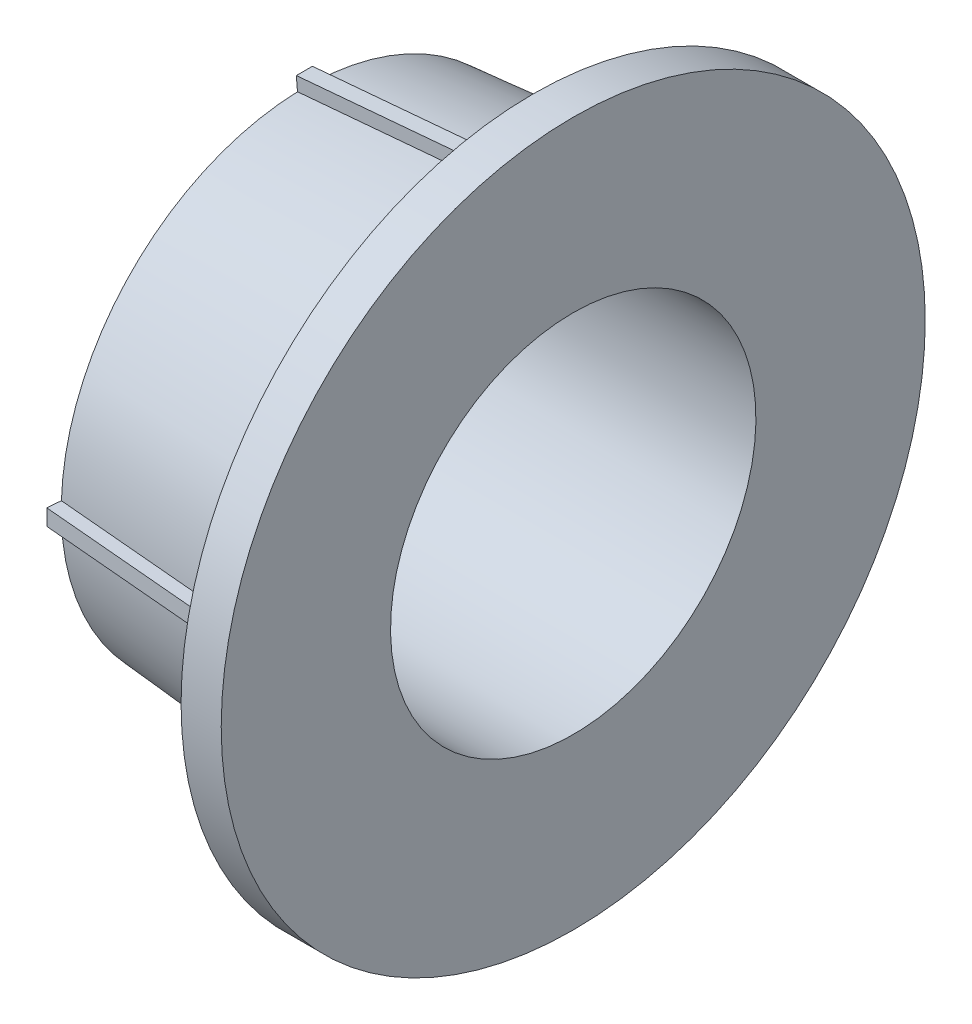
ISO-10303-21;
HEADER;
FILE_DESCRIPTION(('STEP AP214'),'2;1');
FILE_NAME('part.step','',(''),(''),'','','');
FILE_SCHEMA(('AUTOMOTIVE_DESIGN { 1 0 10303 214 1 1 1 1 }'));
ENDSEC;
DATA;
#1=APPLICATION_CONTEXT('core data for automotive mechanical design processes');
#2=APPLICATION_PROTOCOL_DEFINITION('international standard','automotive_design',2000,#1);
#3=PRODUCT_CONTEXT('',#1,'mechanical');
#4=PRODUCT('Part','Part','',(#3));
#5=PRODUCT_RELATED_PRODUCT_CATEGORY('part','',(#4));
#6=PRODUCT_DEFINITION_FORMATION('','',#4);
#7=PRODUCT_DEFINITION_CONTEXT('part definition',#1,'design');
#8=PRODUCT_DEFINITION('design','',#6,#7);
#9=PRODUCT_DEFINITION_SHAPE('','',#8);
#10=(LENGTH_UNIT() NAMED_UNIT(*) SI_UNIT(.MILLI.,.METRE.));
#11=(NAMED_UNIT(*) PLANE_ANGLE_UNIT() SI_UNIT($,.RADIAN.));
#12=(NAMED_UNIT(*) SI_UNIT($,.STERADIAN.) SOLID_ANGLE_UNIT());
#13=UNCERTAINTY_MEASURE_WITH_UNIT(LENGTH_MEASURE(1.E-05),#10,'distance_accuracy_value','');
#14=(GEOMETRIC_REPRESENTATION_CONTEXT(3) GLOBAL_UNCERTAINTY_ASSIGNED_CONTEXT((#13)) GLOBAL_UNIT_ASSIGNED_CONTEXT((#10,
#11,#12)) REPRESENTATION_CONTEXT('',''));
#15=CARTESIAN_POINT('',(0.,0.,0.));
#16=DIRECTION('',(0.,0.,1.));
#17=DIRECTION('',(1.,0.,0.));
#18=AXIS2_PLACEMENT_3D('',#15,#16,#17);
#19=CARTESIAN_POINT('',(16.9999999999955,29.6900321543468,-2.23776048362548E-12));
#20=DIRECTION('',(1.,0.,0.));
#21=DIRECTION('',(0.,-1.,0.));
#22=AXIS2_PLACEMENT_3D('',#19,#20,#21);
#23=CONICAL_SURFACE('',#22,19.7375000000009,0.0872777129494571);
#24=CARTESIAN_POINT('',(16.9999999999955,29.6900321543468,-2.23776048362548E-12));
#25=DIRECTION('',(-1.,0.,0.));
#26=DIRECTION('',(0.,-1.,0.));
#27=AXIS2_PLACEMENT_3D('',#24,#25,#26);
#28=CIRCLE('',#27,19.7375000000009);
#29=CARTESIAN_POINT('',(16.9999999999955,9.96165395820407,0.599999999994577));
#30=VERTEX_POINT('',#29);
#31=CARTESIAN_POINT('',(16.9999999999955,29.0900321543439,19.7283781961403));
#32=VERTEX_POINT('',#31);
#33=EDGE_CURVE('E376',#30,#32,#28,.T.);
#34=ORIENTED_EDGE('',*,*,#33,.T.);
#35=CARTESIAN_POINT('',(-30.1550080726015,29.0900321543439,15.5999025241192));
#36=CARTESIAN_POINT('',(-20.618338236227,29.0900321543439,16.43497432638));
#37=CARTESIAN_POINT('',(-11.0816605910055,29.0900321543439,17.2699569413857));
#38=CARTESIAN_POINT('',(0.276339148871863,29.0900321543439,18.2643278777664));
#39=CARTESIAN_POINT('',(2.09765580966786,29.0900321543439,18.4237782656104));
#40=CARTESIAN_POINT('',(15.2769748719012,29.0900321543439,19.5775691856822));
#41=CARTESIAN_POINT('',(26.634984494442,29.0900321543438,20.5718272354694));
#42=CARTESIAN_POINT('',(37.9929978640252,29.0900321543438,21.5660424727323));
#43=B_SPLINE_CURVE_WITH_KNOTS('',3,(#35,#36,#37,#38,#39,#40,#41,#42),.UNSPECIFIED.,.F.,.F.,(4,2,
2,4),(0.,28.7194837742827,34.2043328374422,68.4086656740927),.UNSPECIFIED.);
#44=CARTESIAN_POINT('',(1.43938680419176E-12,29.0900321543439,18.240134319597));
#45=VERTEX_POINT('',#44);
#46=EDGE_CURVE('E180',#45,#32,#43,.T.);
#47=ORIENTED_EDGE('',*,*,#46,.F.);
#48=CARTESIAN_POINT('',(-1.73819292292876E-11,29.6900321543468,-2.229054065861E-12));
#49=DIRECTION('',(-1.,0.,0.));
#50=DIRECTION('',(0.,-1.,0.));
#51=AXIS2_PLACEMENT_3D('',#48,#49,#50);
#52=CIRCLE('',#51,18.2499999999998);
#53=CARTESIAN_POINT('',(-1.7402716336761E-11,11.449897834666,0.599999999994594));
#54=VERTEX_POINT('',#53);
#55=EDGE_CURVE('E709',#54,#45,#52,.T.);
#56=ORIENTED_EDGE('',*,*,#55,.F.);
#57=CARTESIAN_POINT('',(37.993112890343,8.12397961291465,0.599999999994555));
#58=CARTESIAN_POINT('',(26.6350917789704,9.11816741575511,0.599999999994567));
#59=CARTESIAN_POINT('',(15.2770780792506,10.1124398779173,0.599999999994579));
#60=CARTESIAN_POINT('',(-7.43893449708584,12.1011541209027,0.599999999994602));
#61=CARTESIAN_POINT('',(-18.7969333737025,13.095595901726,0.599999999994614));
#62=CARTESIAN_POINT('',(-30.1549248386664,14.090122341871,0.599999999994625));
#63=B_SPLINE_CURVE_WITH_KNOTS('',3,(#57,#58,#59,#60,#61,#62),.UNSPECIFIED.,.F.,.F.,(4,2,4),(0.,
34.2043487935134,68.4086975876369),.UNSPECIFIED.);
#64=EDGE_CURVE('E260',#30,#54,#63,.T.);
#65=ORIENTED_EDGE('',*,*,#64,.F.);
#66=EDGE_LOOP('',(#34,#47,#56,#65));
#67=FACE_BOUND('',#66,.T.);
#68=ADVANCED_FACE('F33',(#67),#23,.T.);
#69=CARTESIAN_POINT('',(16.9999999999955,29.0900321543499,-19.7283781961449));
#70=VERTEX_POINT('',#69);
#71=CARTESIAN_POINT('',(16.9999999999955,9.96165395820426,-0.60000000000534));
#72=VERTEX_POINT('',#71);
#73=EDGE_CURVE('E381',#70,#72,#28,.T.);
#74=ORIENTED_EDGE('',*,*,#73,.T.);
#75=CARTESIAN_POINT('',(-30.1549248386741,14.0901223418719,-0.600000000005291));
#76=CARTESIAN_POINT('',(-20.6182505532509,13.255050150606,-0.600000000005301));
#77=CARTESIAN_POINT('',(-11.0815684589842,12.4200671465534,-0.600000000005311));
#78=CARTESIAN_POINT('',(0.276436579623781,11.4256957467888,-0.600000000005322));
#79=CARTESIAN_POINT('',(2.09775409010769,11.2662452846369,-0.600000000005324));
#80=CARTESIAN_POINT('',(15.2770793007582,10.1124538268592,-0.600000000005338));
#81=CARTESIAN_POINT('',(26.6350942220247,9.11819531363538,-0.60000000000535));
#82=CARTESIAN_POINT('',(37.9931128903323,8.12397961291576,-0.600000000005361));
#83=B_SPLINE_CURVE_WITH_KNOTS('',3,(#75,#76,#77,#78,#79,#80,#81,#82),.UNSPECIFIED.,.F.,.F.,(4,2,
2,4),(0.,28.7194971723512,34.2043487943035,68.4086975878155),.UNSPECIFIED.);
#84=CARTESIAN_POINT('',(1.07162542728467E-12,11.4498978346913,-0.600000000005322));
#85=VERTEX_POINT('',#84);
#86=EDGE_CURVE('E252',#85,#72,#83,.T.);
#87=ORIENTED_EDGE('',*,*,#86,.F.);
#88=CARTESIAN_POINT('',(-1.73919646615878E-11,29.0900321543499,-18.240134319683));
#89=VERTEX_POINT('',#88);
#90=EDGE_CURVE('E396',#89,#85,#52,.T.);
#91=ORIENTED_EDGE('',*,*,#90,.F.);
#92=CARTESIAN_POINT('',(37.9929978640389,29.0900321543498,-21.5660424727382));
#93=CARTESIAN_POINT('',(26.6349820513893,29.0900321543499,-20.5718551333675));
#94=CARTESIAN_POINT('',(15.276973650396,29.0900321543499,-19.5775831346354));
#95=CARTESIAN_POINT('',(-7.43902832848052,29.0900321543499,-17.588869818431));
#96=CARTESIAN_POINT('',(-18.7970219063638,29.0900321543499,-16.5944285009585));
#97=CARTESIAN_POINT('',(-30.1550080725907,29.0900321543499,-15.5999025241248));
#98=B_SPLINE_CURVE_WITH_KNOTS('',3,(#92,#93,#94,#95,#96,#97),.UNSPECIFIED.,.F.,.F.,(4,2,4),(0.,
34.204332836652,68.408665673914),.UNSPECIFIED.);
#99=EDGE_CURVE('E297',#70,#89,#98,.T.);
#100=ORIENTED_EDGE('',*,*,#99,.F.);
#101=EDGE_LOOP('',(#74,#87,#91,#100));
#102=FACE_BOUND('',#101,.T.);
#103=ADVANCED_FACE('F364',(#102),#23,.T.);
#104=CARTESIAN_POINT('',(16.9999999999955,49.4184103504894,-0.599999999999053));
#105=VERTEX_POINT('',#104);
#106=CARTESIAN_POINT('',(16.9999999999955,30.2900321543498,-19.7283781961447));
#107=VERTEX_POINT('',#106);
#108=EDGE_CURVE('E399',#105,#107,#28,.T.);
#109=ORIENTED_EDGE('',*,*,#108,.T.);
#110=CARTESIAN_POINT('',(-30.1550080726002,30.2900321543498,-15.5999025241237));
#111=CARTESIAN_POINT('',(-20.6183382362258,30.2900321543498,-16.4349743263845));
#112=CARTESIAN_POINT('',(-11.0816605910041,30.2900321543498,-17.2699569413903));
#113=CARTESIAN_POINT('',(0.276339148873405,30.2900321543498,-18.264327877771));
#114=CARTESIAN_POINT('',(2.09765580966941,30.2900321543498,-18.423778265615));
#115=CARTESIAN_POINT('',(15.2769748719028,30.2900321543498,-19.5775691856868));
#116=CARTESIAN_POINT('',(26.6349844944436,30.2900321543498,-20.571827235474));
#117=CARTESIAN_POINT('',(37.9929978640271,30.2900321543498,-21.566042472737));
#118=B_SPLINE_CURVE_WITH_KNOTS('',3,(#110,#111,#112,#113,#114,#115,#116,#117),.UNSPECIFIED.,.F.,
.F.,(4,2,2,4),(0.,28.7194837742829,34.2043328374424,68.4086656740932),.UNSPECIFIED.);
#119=CARTESIAN_POINT('',(-6.38486659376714E-12,30.2900321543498,-18.2401343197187));
#120=VERTEX_POINT('',#119);
#121=EDGE_CURVE('E289',#120,#107,#118,.T.);
#122=ORIENTED_EDGE('',*,*,#121,.F.);
#123=CARTESIAN_POINT('',(-1.73611421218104E-11,47.9301664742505,-0.599999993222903));
#124=VERTEX_POINT('',#123);
#125=EDGE_CURVE('E394',#124,#120,#52,.T.);
#126=ORIENTED_EDGE('',*,*,#125,.F.);
#127=CARTESIAN_POINT('',(37.9929978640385,51.2560746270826,-0.599999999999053));
#128=CARTESIAN_POINT('',(26.6349820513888,50.2618872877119,-0.599999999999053));
#129=CARTESIAN_POINT('',(15.2769736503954,49.2676152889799,-0.599999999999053));
#130=CARTESIAN_POINT('',(-7.43902832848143,47.2789019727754,-0.599999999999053));
#131=CARTESIAN_POINT('',(-18.7970219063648,46.284460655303,-0.599999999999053));
#132=CARTESIAN_POINT('',(-30.1550080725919,45.2899346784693,-0.599999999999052));
#133=B_SPLINE_CURVE_WITH_KNOTS('',3,(#127,#128,#129,#130,#131,#132),.UNSPECIFIED.,.F.,.F.,(4,2,
4),(0.,34.2043328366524,68.4086656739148),.UNSPECIFIED.);
#134=EDGE_CURVE('E334',#105,#124,#133,.T.);
#135=ORIENTED_EDGE('',*,*,#134,.F.);
#136=EDGE_LOOP('',(#109,#122,#126,#135));
#137=FACE_BOUND('',#136,.T.);
#138=ADVANCED_FACE('F354',(#137),#23,.T.);
#139=CARTESIAN_POINT('',(16.9999999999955,55.9900321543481,0.));
#140=DIRECTION('',(-1.,0.,0.));
#141=DIRECTION('',(0.,-1.,0.));
#142=AXIS2_PLACEMENT_3D('',#139,#140,#141);
#143=PLANE('',#142);
#144=DIRECTION('',(0.,0.,-1.));
#145=VECTOR('',#144,1.);
#146=CARTESIAN_POINT('',(16.9999999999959,29.0900321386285,-500001.48757496));
#147=LINE('',#146,#145);
#148=CARTESIAN_POINT('',(16.9999999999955,29.0900321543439,19.7374999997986));
#149=VERTEX_POINT('',#148);
#150=EDGE_CURVE('E209',#149,#32,#147,.T.);
#151=ORIENTED_EDGE('',*,*,#150,.T.);
#152=ORIENTED_EDGE('',*,*,#33,.F.);
#153=DIRECTION('',(0.,-1.,0.));
#154=VECTOR('',#153,1.);
#155=CARTESIAN_POINT('',(17.0000000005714,500000.,0.599999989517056));
#156=LINE('',#155,#154);
#157=CARTESIAN_POINT('',(16.9999999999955,9.95253215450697,0.599999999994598));
#158=VERTEX_POINT('',#157);
#159=EDGE_CURVE('E262',#30,#158,#156,.T.);
#160=ORIENTED_EDGE('',*,*,#159,.T.);
#161=DIRECTION('',(0.,0.,-1.));
#162=VECTOR('',#161,1.);
#163=CARTESIAN_POINT('',(16.9999999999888,9.95253215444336,-0.600000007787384));
#164=LINE('',#163,#162);
#165=CARTESIAN_POINT('',(16.9999999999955,9.95253215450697,-0.60000000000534));
#166=VERTEX_POINT('',#165);
#167=EDGE_CURVE('E447',#158,#166,#164,.T.);
#168=ORIENTED_EDGE('',*,*,#167,.T.);
#169=DIRECTION('',(0.,1.,0.));
#170=VECTOR('',#169,1.);
#171=CARTESIAN_POINT('',(17.0000000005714,500001.48757496,-0.600000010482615));
#172=LINE('',#171,#170);
#173=EDGE_CURVE('E434',#166,#72,#172,.T.);
#174=ORIENTED_EDGE('',*,*,#173,.T.);
#175=ORIENTED_EDGE('',*,*,#73,.F.);
#176=DIRECTION('',(0.,0.,-1.));
#177=VECTOR('',#176,1.);
#178=CARTESIAN_POINT('',(16.9999999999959,29.0900321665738,500000.));
#179=LINE('',#178,#177);
#180=CARTESIAN_POINT('',(16.9999999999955,29.0900321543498,-19.7374999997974));
#181=VERTEX_POINT('',#180);
#182=EDGE_CURVE('E299',#70,#181,#179,.T.);
#183=ORIENTED_EDGE('',*,*,#182,.T.);
#184=DIRECTION('',(0.,1.,0.));
#185=VECTOR('',#184,1.);
#186=CARTESIAN_POINT('',(16.9999999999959,30.2900321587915,-19.7374999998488));
#187=LINE('',#186,#185);
#188=CARTESIAN_POINT('',(16.9999999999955,30.2900321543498,-19.7374999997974));
#189=VERTEX_POINT('',#188);
#190=EDGE_CURVE('E461',#181,#189,#187,.T.);
#191=ORIENTED_EDGE('',*,*,#190,.T.);
#192=DIRECTION('',(0.,0.,1.));
#193=VECTOR('',#192,1.);
#194=CARTESIAN_POINT('',(16.9999999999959,30.2900321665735,500001.48757496));
#195=LINE('',#194,#193);
#196=EDGE_CURVE('E459',#189,#107,#195,.T.);
#197=ORIENTED_EDGE('',*,*,#196,.T.);
#198=ORIENTED_EDGE('',*,*,#108,.F.);
#199=DIRECTION('',(0.,1.,0.));
#200=VECTOR('',#199,1.);
#201=CARTESIAN_POINT('',(16.9999999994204,-500000.,-0.599999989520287));
#202=LINE('',#201,#200);
#203=CARTESIAN_POINT('',(16.9999999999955,49.4275321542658,-0.599999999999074));
#204=VERTEX_POINT('',#203);
#205=EDGE_CURVE('E405',#105,#204,#202,.T.);
#206=ORIENTED_EDGE('',*,*,#205,.T.);
#207=DIRECTION('',(0.,0.,1.));
#208=VECTOR('',#207,1.);
#209=CARTESIAN_POINT('',(16.9999999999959,49.4275321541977,0.600000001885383));
#210=LINE('',#209,#208);
#211=CARTESIAN_POINT('',(16.9999999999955,49.4275321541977,0.600000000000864));
#212=VERTEX_POINT('',#211);
#213=EDGE_CURVE('E336',#204,#212,#210,.T.);
#214=ORIENTED_EDGE('',*,*,#213,.T.);
#215=DIRECTION('',(0.,-1.,0.));
#216=VECTOR('',#215,1.);
#217=CARTESIAN_POINT('',(16.9999999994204,-500001.48757496,0.600000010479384));
#218=LINE('',#217,#216);
#219=CARTESIAN_POINT('',(16.9999999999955,49.4184103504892,0.600000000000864));
#220=VERTEX_POINT('',#219);
#221=EDGE_CURVE('E404',#212,#220,#218,.T.);
#222=ORIENTED_EDGE('',*,*,#221,.T.);
#223=CARTESIAN_POINT('',(16.9999999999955,30.2900321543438,19.7283781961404));
#224=VERTEX_POINT('',#223);
#225=EDGE_CURVE('E382',#224,#220,#28,.T.);
#226=ORIENTED_EDGE('',*,*,#225,.F.);
#227=DIRECTION('',(0.,0.,1.));
#228=VECTOR('',#227,1.);
#229=CARTESIAN_POINT('',(16.9999999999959,30.2900321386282,-500000.));
#230=LINE('',#229,#228);
#231=CARTESIAN_POINT('',(16.9999999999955,30.2900321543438,19.7374999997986));
#232=VERTEX_POINT('',#231);
#233=EDGE_CURVE('E212',#224,#232,#230,.T.);
#234=ORIENTED_EDGE('',*,*,#233,.T.);
#235=DIRECTION('',(0.,-1.,0.));
#236=VECTOR('',#235,1.);
#237=CARTESIAN_POINT('',(16.9999999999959,29.0900321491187,19.7374999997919));
#238=LINE('',#237,#236);
#239=EDGE_CURVE('E49',#232,#149,#238,.T.);
#240=ORIENTED_EDGE('',*,*,#239,.T.);
#241=EDGE_LOOP('',(#151,#152,#160,#168,#174,#175,#183,#191,#197,#198,#206,#214,#222,#226,#234,#240));
#242=FACE_BOUND('',#241,.T.);
#243=CARTESIAN_POINT('',(16.9999999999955,29.6900321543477,0.));
#244=DIRECTION('',(1.,0.,0.));
#245=DIRECTION('',(0.,1.,0.));
#246=AXIS2_PLACEMENT_3D('',#243,#244,#245);
#247=CIRCLE('',#246,26.3000000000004);
#248=CARTESIAN_POINT('',(16.9999999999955,55.9900321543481,0.));
#249=VERTEX_POINT('',#248);
#250=EDGE_CURVE('E11',#249,#249,#247,.T.);
#251=ORIENTED_EDGE('',*,*,#250,.F.);
#252=EDGE_LOOP('',(#251));
#253=FACE_BOUND('',#252,.T.);
#254=ADVANCED_FACE('F357',(#242,#253),#143,.T.);
#255=CARTESIAN_POINT('',(16.9999999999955,29.6900321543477,0.));
#256=DIRECTION('',(1.,0.,0.));
#257=DIRECTION('',(0.,1.,0.));
#258=AXIS2_PLACEMENT_3D('',#255,#256,#257);
#259=CYLINDRICAL_SURFACE('',#258,26.3000000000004);
#260=ORIENTED_EDGE('',*,*,#250,.T.);
#261=EDGE_LOOP('',(#260));
#262=FACE_BOUND('',#261,.T.);
#263=CARTESIAN_POINT('',(19.9999999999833,29.6900321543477,0.));
#264=DIRECTION('',(1.,0.,0.));
#265=DIRECTION('',(0.,1.,0.));
#266=AXIS2_PLACEMENT_3D('',#263,#264,#265);
#267=CIRCLE('',#266,26.3000000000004);
#268=CARTESIAN_POINT('',(19.9999999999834,55.9900321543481,0.));
#269=VERTEX_POINT('',#268);
#270=EDGE_CURVE('E42',#269,#269,#267,.T.);
#271=ORIENTED_EDGE('',*,*,#270,.F.);
#272=EDGE_LOOP('',(#271));
#273=FACE_BOUND('',#272,.T.);
#274=ADVANCED_FACE('F35',(#262,#273),#259,.T.);
#275=CARTESIAN_POINT('',(19.9999999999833,29.6900321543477,0.));
#276=DIRECTION('',(1.,0.,0.));
#277=DIRECTION('',(0.,1.,0.));
#278=AXIS2_PLACEMENT_3D('',#275,#276,#277);
#279=PLANE('',#278);
#280=CARTESIAN_POINT('',(19.9999999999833,29.6900321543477,0.));
#281=DIRECTION('',(1.,0.,0.));
#282=DIRECTION('',(0.,1.,0.));
#283=AXIS2_PLACEMENT_3D('',#280,#281,#282);
#284=CIRCLE('',#283,13.65);
#285=CARTESIAN_POINT('',(19.9999999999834,43.3400321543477,0.));
#286=VERTEX_POINT('',#285);
#287=EDGE_CURVE('E198',#286,#286,#284,.T.);
#288=ORIENTED_EDGE('',*,*,#287,.F.);
#289=EDGE_LOOP('',(#288));
#290=FACE_BOUND('',#289,.T.);
#291=ORIENTED_EDGE('',*,*,#270,.T.);
#292=EDGE_LOOP('',(#291));
#293=FACE_BOUND('',#292,.T.);
#294=ADVANCED_FACE('F352',(#290,#293),#279,.T.);
#295=CARTESIAN_POINT('',(-1.73718937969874E-11,30.2900321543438,18.2401343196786));
#296=VERTEX_POINT('',#295);
#297=CARTESIAN_POINT('',(-1.28315079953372E-11,47.9301664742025,0.600000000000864));
#298=VERTEX_POINT('',#297);
#299=EDGE_CURVE('E398',#296,#298,#52,.T.);
#300=ORIENTED_EDGE('',*,*,#299,.F.);
#301=CARTESIAN_POINT('',(37.9929978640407,30.2900321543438,21.5660424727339));
#302=CARTESIAN_POINT('',(26.634982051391,30.2900321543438,20.5718551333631));
#303=CARTESIAN_POINT('',(15.2769736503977,30.2900321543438,19.5775831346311));
#304=CARTESIAN_POINT('',(-7.43902832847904,30.2900321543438,17.5888698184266));
#305=CARTESIAN_POINT('',(-18.7970219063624,30.2900321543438,16.5944285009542));
#306=CARTESIAN_POINT('',(-30.1550080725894,30.2900321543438,15.5999025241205));
#307=B_SPLINE_CURVE_WITH_KNOTS('',3,(#301,#302,#303,#304,#305,#306),.UNSPECIFIED.,.F.,.F.,(4,2,
4),(0.,34.2043328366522,68.4086656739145),.UNSPECIFIED.);
#308=EDGE_CURVE('E177',#224,#296,#307,.T.);
#309=ORIENTED_EDGE('',*,*,#308,.F.);
#310=ORIENTED_EDGE('',*,*,#225,.T.);
#311=CARTESIAN_POINT('',(-30.1550080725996,45.2899346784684,0.600000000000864));
#312=CARTESIAN_POINT('',(-20.618338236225,46.1250064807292,0.600000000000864));
#313=CARTESIAN_POINT('',(-11.0816605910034,46.9599890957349,0.600000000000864));
#314=CARTESIAN_POINT('',(0.276339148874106,47.9543600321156,0.600000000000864));
#315=CARTESIAN_POINT('',(2.09765580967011,48.1138104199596,0.600000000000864));
#316=CARTESIAN_POINT('',(15.2769748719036,49.2676013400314,0.600000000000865));
#317=CARTESIAN_POINT('',(26.6349844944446,50.2618593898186,0.600000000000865));
#318=CARTESIAN_POINT('',(37.9929978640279,51.2560746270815,0.600000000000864));
#319=B_SPLINE_CURVE_WITH_KNOTS('',3,(#311,#312,#313,#314,#315,#316,#317,#318),.UNSPECIFIED.,.F.,
.F.,(4,2,2,4),(0.,28.719483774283,34.2043328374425,68.4086656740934),.UNSPECIFIED.);
#320=EDGE_CURVE('E326',#298,#220,#319,.T.);
#321=ORIENTED_EDGE('',*,*,#320,.F.);
#322=EDGE_LOOP('',(#300,#309,#310,#321));
#323=FACE_BOUND('',#322,.T.);
#324=ADVANCED_FACE('F348',(#323),#23,.T.);
#325=CARTESIAN_POINT('',(-1.73819292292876E-11,29.6900321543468,-2.229054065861E-12));
#326=DIRECTION('',(-1.,0.,0.));
#327=DIRECTION('',(0.,-1.,0.));
#328=AXIS2_PLACEMENT_3D('',#325,#326,#327);
#329=PLANE('',#328);
#330=CARTESIAN_POINT('',(-1.73819292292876E-11,29.6900321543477,0.));
#331=DIRECTION('',(-1.,0.,0.));
#332=DIRECTION('',(0.,-1.,0.));
#333=AXIS2_PLACEMENT_3D('',#330,#331,#332);
#334=CIRCLE('',#333,13.65);
#335=CARTESIAN_POINT('',(-1.73977152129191E-11,16.0400321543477,0.));
#336=VERTEX_POINT('',#335);
#337=EDGE_CURVE('E37',#336,#336,#334,.T.);
#338=ORIENTED_EDGE('',*,*,#337,.F.);
#339=EDGE_LOOP('',(#338));
#340=FACE_BOUND('',#339,.T.);
#341=DIRECTION('',(0.,1.,0.));
#342=VECTOR('',#341,1.);
#343=CARTESIAN_POINT('',(-1.4210854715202E-11,30.2900321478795,18.2401343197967));
#344=LINE('',#343,#342);
#345=EDGE_CURVE('E211',#45,#296,#344,.T.);
#346=ORIENTED_EDGE('',*,*,#345,.T.);
#347=ORIENTED_EDGE('',*,*,#299,.T.);
#348=DIRECTION('',(0.,0.,-1.));
#349=VECTOR('',#348,1.);
#350=CARTESIAN_POINT('',(-1.4210854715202E-11,47.9301664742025,-0.599999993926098));
#351=LINE('',#350,#349);
#352=EDGE_CURVE('E402',#298,#124,#351,.T.);
#353=ORIENTED_EDGE('',*,*,#352,.T.);
#354=ORIENTED_EDGE('',*,*,#125,.T.);
#355=DIRECTION('',(0.,-1.,0.));
#356=VECTOR('',#355,1.);
#357=CARTESIAN_POINT('',(-1.4210854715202E-11,29.0900321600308,-18.2401343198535));
#358=LINE('',#357,#356);
#359=EDGE_CURVE('E457',#120,#89,#358,.T.);
#360=ORIENTED_EDGE('',*,*,#359,.T.);
#361=ORIENTED_EDGE('',*,*,#90,.T.);
#362=DIRECTION('',(0.,0.,1.));
#363=VECTOR('',#362,1.);
#364=CARTESIAN_POINT('',(-2.1316282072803E-11,11.4498978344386,0.599999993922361));
#365=LINE('',#364,#363);
#366=EDGE_CURVE('E428',#85,#54,#365,.T.);
#367=ORIENTED_EDGE('',*,*,#366,.T.);
#368=ORIENTED_EDGE('',*,*,#55,.T.);
#369=EDGE_LOOP('',(#346,#347,#353,#354,#360,#361,#367,#368));
#370=FACE_BOUND('',#369,.T.);
#371=ADVANCED_FACE('F314',(#340,#370),#329,.T.);
#372=CARTESIAN_POINT('',(43771.3249090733,-500000.,0.600000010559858));
#373=DIRECTION('',(0.996193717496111,0.0871669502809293,0.));
#374=DIRECTION('',(-0.0871669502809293,0.996193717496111,0.));
#375=AXIS2_PLACEMENT_3D('',#372,#373,#374);
#376=PLANE('',#375);
#377=ORIENTED_EDGE('',*,*,#213,.F.);
#378=DIRECTION('',(-0.0871669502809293,0.996193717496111,0.));
#379=VECTOR('',#378,1.);
#380=CARTESIAN_POINT('',(43771.3249090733,-500000.,-0.599999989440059));
#381=LINE('',#380,#379);
#382=CARTESIAN_POINT('',(16.9128330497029,50.4237258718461,-0.599999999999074));
#383=VERTEX_POINT('',#382);
#384=EDGE_CURVE('E473',#204,#383,#381,.T.);
#385=ORIENTED_EDGE('',*,*,#384,.T.);
#386=DIRECTION('',(0.,0.,-1.));
#387=VECTOR('',#386,1.);
#388=CARTESIAN_POINT('',(16.9128330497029,50.4237258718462,0.600000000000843));
#389=LINE('',#388,#387);
#390=CARTESIAN_POINT('',(16.9128330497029,50.4237258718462,0.600000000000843));
#391=VERTEX_POINT('',#390);
#392=EDGE_CURVE('E470',#391,#383,#389,.T.);
#393=ORIENTED_EDGE('',*,*,#392,.F.);
#394=DIRECTION('',(-0.0871669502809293,0.996193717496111,0.));
#395=VECTOR('',#394,1.);
#396=CARTESIAN_POINT('',(43771.3249090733,-500000.,0.600000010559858));
#397=LINE('',#396,#395);
#398=EDGE_CURVE('E477',#212,#391,#397,.T.);
#399=ORIENTED_EDGE('',*,*,#398,.F.);
#400=EDGE_LOOP('',(#377,#385,#393,#399));
#401=FACE_BOUND('',#400,.T.);
#402=ADVANCED_FACE('F282',(#401),#376,.T.);
#403=CARTESIAN_POINT('',(43771.3249090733,-500000.,-0.599999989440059));
#404=DIRECTION('',(0.,0.,-1.));
#405=DIRECTION('',(0.,1.,0.));
#406=AXIS2_PLACEMENT_3D('',#403,#404,#405);
#407=PLANE('',#406);
#408=ORIENTED_EDGE('',*,*,#205,.F.);
#409=ORIENTED_EDGE('',*,*,#134,.T.);
#410=DIRECTION('',(-0.0871669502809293,0.996193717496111,0.));
#411=VECTOR('',#410,1.);
#412=CARTESIAN_POINT('',(43754.3240523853,-500001.48757496,-0.599999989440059));
#413=LINE('',#412,#411);
#414=CARTESIAN_POINT('',(-0.0880236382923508,48.9361509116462,-0.599999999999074));
#415=VERTEX_POINT('',#414);
#416=EDGE_CURVE('E335',#124,#415,#413,.T.);
#417=ORIENTED_EDGE('',*,*,#416,.T.);
#418=DIRECTION('',(-0.996193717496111,-0.0871669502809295,0.));
#419=VECTOR('',#418,1.);
#420=CARTESIAN_POINT('',(16.9128330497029,50.4237258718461,-0.599999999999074));
#421=LINE('',#420,#419);
#422=EDGE_CURVE('E467',#383,#415,#421,.T.);
#423=ORIENTED_EDGE('',*,*,#422,.F.);
#424=ORIENTED_EDGE('',*,*,#384,.F.);
#425=EDGE_LOOP('',(#408,#409,#417,#423,#424));
#426=FACE_BOUND('',#425,.T.);
#427=ADVANCED_FACE('F317',(#426),#407,.T.);
#428=CARTESIAN_POINT('',(43754.3240523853,-500001.48757496,-0.599999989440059));
#429=DIRECTION('',(-0.996193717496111,-0.0871669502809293,0.));
#430=DIRECTION('',(0.0871669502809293,-0.996193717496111,0.));
#431=AXIS2_PLACEMENT_3D('',#428,#429,#430);
#432=PLANE('',#431);
#433=ORIENTED_EDGE('',*,*,#352,.F.);
#434=DIRECTION('',(-0.0871669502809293,0.996193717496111,0.));
#435=VECTOR('',#434,1.);
#436=CARTESIAN_POINT('',(43754.3240523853,-500001.48757496,0.600000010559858));
#437=LINE('',#436,#435);
#438=CARTESIAN_POINT('',(-0.0880236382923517,48.9361509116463,0.600000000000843));
#439=VERTEX_POINT('',#438);
#440=EDGE_CURVE('E479',#298,#439,#437,.T.);
#441=ORIENTED_EDGE('',*,*,#440,.T.);
#442=DIRECTION('',(0.,0.,1.));
#443=VECTOR('',#442,1.);
#444=CARTESIAN_POINT('',(-0.0880236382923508,48.9361509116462,-0.599999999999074));
#445=LINE('',#444,#443);
#446=EDGE_CURVE('E463',#415,#439,#445,.T.);
#447=ORIENTED_EDGE('',*,*,#446,.F.);
#448=ORIENTED_EDGE('',*,*,#416,.F.);
#449=EDGE_LOOP('',(#433,#441,#447,#448));
#450=FACE_BOUND('',#449,.T.);
#451=ADVANCED_FACE('F322',(#450),#432,.T.);
#452=CARTESIAN_POINT('',(43754.3240523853,-500001.48757496,0.600000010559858));
#453=DIRECTION('',(0.,0.,1.));
#454=DIRECTION('',(0.,-1.,0.));
#455=AXIS2_PLACEMENT_3D('',#452,#453,#454);
#456=PLANE('',#455);
#457=ORIENTED_EDGE('',*,*,#221,.F.);
#458=ORIENTED_EDGE('',*,*,#398,.T.);
#459=DIRECTION('',(0.996193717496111,0.0871669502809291,0.));
#460=VECTOR('',#459,1.);
#461=CARTESIAN_POINT('',(-0.0880236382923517,48.9361509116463,0.600000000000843));
#462=LINE('',#461,#460);
#463=EDGE_CURVE('E466',#439,#391,#462,.T.);
#464=ORIENTED_EDGE('',*,*,#463,.F.);
#465=ORIENTED_EDGE('',*,*,#440,.F.);
#466=ORIENTED_EDGE('',*,*,#320,.T.);
#467=EDGE_LOOP('',(#457,#458,#464,#465,#466));
#468=FACE_BOUND('',#467,.T.);
#469=ADVANCED_FACE('F312',(#468),#456,.T.);
#470=CARTESIAN_POINT('',(-0.0880236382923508,48.9361509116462,-0.599999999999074));
#471=DIRECTION('',(-0.0871669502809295,0.996193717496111,0.));
#472=DIRECTION('',(-0.996193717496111,-0.0871669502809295,0.));
#473=AXIS2_PLACEMENT_3D('',#470,#471,#472);
#474=PLANE('',#473);
#475=ORIENTED_EDGE('',*,*,#422,.T.);
#476=ORIENTED_EDGE('',*,*,#446,.T.);
#477=ORIENTED_EDGE('',*,*,#463,.T.);
#478=ORIENTED_EDGE('',*,*,#392,.T.);
#479=EDGE_LOOP('',(#475,#476,#477,#478));
#480=FACE_BOUND('',#479,.T.);
#481=ADVANCED_FACE('F308',(#480),#474,.T.);
#482=CARTESIAN_POINT('',(43751.7261745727,29.0900321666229,500001.48757496));
#483=DIRECTION('',(-0.996193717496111,0.,0.087166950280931));
#484=DIRECTION('',(0.087166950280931,0.,0.996193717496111));
#485=AXIS2_PLACEMENT_3D('',#482,#483,#484);
#486=PLANE('',#485);
#487=ORIENTED_EDGE('',*,*,#359,.F.);
#488=DIRECTION('',(-0.087166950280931,0.,-0.996193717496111));
#489=VECTOR('',#488,1.);
#490=CARTESIAN_POINT('',(43751.7261745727,30.2900321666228,500001.48757496));
#491=LINE('',#490,#489);
#492=CARTESIAN_POINT('',(-0.0880236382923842,30.2900321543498,-19.2461187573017));
#493=VERTEX_POINT('',#492);
#494=EDGE_CURVE('E499',#120,#493,#491,.T.);
#495=ORIENTED_EDGE('',*,*,#494,.T.);
#496=DIRECTION('',(0.,1.,0.));
#497=VECTOR('',#496,1.);
#498=CARTESIAN_POINT('',(-0.0880236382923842,29.0900321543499,-19.2461187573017));
#499=LINE('',#498,#497);
#500=CARTESIAN_POINT('',(-0.0880236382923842,29.0900321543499,-19.2461187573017));
#501=VERTEX_POINT('',#500);
#502=EDGE_CURVE('E520',#501,#493,#499,.T.);
#503=ORIENTED_EDGE('',*,*,#502,.F.);
#504=DIRECTION('',(-0.087166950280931,0.,-0.996193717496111));
#505=VECTOR('',#504,1.);
#506=CARTESIAN_POINT('',(43751.7261745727,29.0900321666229,500001.48757496));
#507=LINE('',#506,#505);
#508=EDGE_CURVE('E298',#89,#501,#507,.T.);
#509=ORIENTED_EDGE('',*,*,#508,.F.);
#510=EDGE_LOOP('',(#487,#495,#503,#509));
#511=FACE_BOUND('',#510,.T.);
#512=ADVANCED_FACE('F244',(#511),#486,.T.);
#513=CARTESIAN_POINT('',(43751.7261745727,30.2900321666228,500001.48757496));
#514=DIRECTION('',(0.,1.,0.));
#515=DIRECTION('',(0.,0.,1.));
#516=AXIS2_PLACEMENT_3D('',#513,#514,#515);
#517=PLANE('',#516);
#518=ORIENTED_EDGE('',*,*,#494,.F.);
#519=ORIENTED_EDGE('',*,*,#121,.T.);
#520=ORIENTED_EDGE('',*,*,#196,.F.);
#521=DIRECTION('',(-0.087166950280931,0.,-0.996193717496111));
#522=VECTOR('',#521,1.);
#523=CARTESIAN_POINT('',(43768.7270312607,30.2900321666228,500000.));
#524=LINE('',#523,#522);
#525=CARTESIAN_POINT('',(16.9128330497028,30.2900321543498,-20.7336937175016));
#526=VERTEX_POINT('',#525);
#527=EDGE_CURVE('E505',#189,#526,#524,.T.);
#528=ORIENTED_EDGE('',*,*,#527,.T.);
#529=DIRECTION('',(0.996193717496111,0.,-0.0871669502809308));
#530=VECTOR('',#529,1.);
#531=CARTESIAN_POINT('',(-0.0880236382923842,30.2900321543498,-19.2461187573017));
#532=LINE('',#531,#530);
#533=EDGE_CURVE('E501',#493,#526,#532,.T.);
#534=ORIENTED_EDGE('',*,*,#533,.F.);
#535=EDGE_LOOP('',(#518,#519,#520,#528,#534));
#536=FACE_BOUND('',#535,.T.);
#537=ADVANCED_FACE('F276',(#536),#517,.T.);
#538=CARTESIAN_POINT('',(-0.0880236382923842,29.0900321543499,-19.2461187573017));
#539=DIRECTION('',(-0.0871669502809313,0.,-0.996193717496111));
#540=DIRECTION('',(-0.996193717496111,0.,0.0871669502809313));
#541=AXIS2_PLACEMENT_3D('',#538,#539,#540);
#542=PLANE('',#541);
#543=DIRECTION('',(-0.996193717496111,0.,0.0871669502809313));
#544=VECTOR('',#543,1.);
#545=CARTESIAN_POINT('',(16.9128330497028,29.0900321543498,-20.7336937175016));
#546=LINE('',#545,#544);
#547=CARTESIAN_POINT('',(16.9128330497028,29.0900321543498,-20.7336937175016));
#548=VERTEX_POINT('',#547);
#549=EDGE_CURVE('E448',#548,#501,#546,.T.);
#550=ORIENTED_EDGE('',*,*,#549,.T.);
#551=ORIENTED_EDGE('',*,*,#502,.T.);
#552=ORIENTED_EDGE('',*,*,#533,.T.);
#553=DIRECTION('',(0.,-1.,0.));
#554=VECTOR('',#553,1.);
#555=CARTESIAN_POINT('',(16.9128330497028,30.2900321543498,-20.7336937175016));
#556=LINE('',#555,#554);
#557=EDGE_CURVE('E517',#526,#548,#556,.T.);
#558=ORIENTED_EDGE('',*,*,#557,.T.);
#559=EDGE_LOOP('',(#550,#551,#552,#558));
#560=FACE_BOUND('',#559,.T.);
#561=ADVANCED_FACE('F271',(#560),#542,.T.);
#562=CARTESIAN_POINT('',(43768.7270312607,29.0900321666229,500000.));
#563=DIRECTION('',(0.,-1.,0.));
#564=DIRECTION('',(0.,0.,-1.));
#565=AXIS2_PLACEMENT_3D('',#562,#563,#564);
#566=PLANE('',#565);
#567=ORIENTED_EDGE('',*,*,#182,.F.);
#568=ORIENTED_EDGE('',*,*,#99,.T.);
#569=ORIENTED_EDGE('',*,*,#508,.T.);
#570=ORIENTED_EDGE('',*,*,#549,.F.);
#571=DIRECTION('',(-0.087166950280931,0.,-0.996193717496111));
#572=VECTOR('',#571,1.);
#573=CARTESIAN_POINT('',(43768.7270312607,29.0900321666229,500000.));
#574=LINE('',#573,#572);
#575=EDGE_CURVE('E508',#181,#548,#574,.T.);
#576=ORIENTED_EDGE('',*,*,#575,.F.);
#577=EDGE_LOOP('',(#567,#568,#569,#570,#576));
#578=FACE_BOUND('',#577,.T.);
#579=ADVANCED_FACE('F275',(#578),#566,.T.);
#580=CARTESIAN_POINT('',(43768.7270312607,30.2900321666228,500000.));
#581=DIRECTION('',(0.996193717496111,0.,-0.087166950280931));
#582=DIRECTION('',(-0.087166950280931,0.,-0.996193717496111));
#583=AXIS2_PLACEMENT_3D('',#580,#581,#582);
#584=PLANE('',#583);
#585=ORIENTED_EDGE('',*,*,#190,.F.);
#586=ORIENTED_EDGE('',*,*,#575,.T.);
#587=ORIENTED_EDGE('',*,*,#557,.F.);
#588=ORIENTED_EDGE('',*,*,#527,.F.);
#589=EDGE_LOOP('',(#585,#586,#587,#588));
#590=FACE_BOUND('',#589,.T.);
#591=ADVANCED_FACE('F278',(#590),#584,.T.);
#592=CARTESIAN_POINT('',(43749.1282967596,500001.48757496,0.599999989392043));
#593=DIRECTION('',(-0.996193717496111,0.0871669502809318,0.));
#594=DIRECTION('',(-0.0871669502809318,-0.996193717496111,0.));
#595=AXIS2_PLACEMENT_3D('',#592,#593,#594);
#596=PLANE('',#595);
#597=ORIENTED_EDGE('',*,*,#366,.F.);
#598=DIRECTION('',(-0.0871669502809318,-0.996193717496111,0.));
#599=VECTOR('',#598,1.);
#600=CARTESIAN_POINT('',(43749.1282967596,500001.48757496,-0.600000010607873));
#601=LINE('',#600,#599);
#602=CARTESIAN_POINT('',(-0.0880236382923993,10.4439133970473,-0.600000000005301));
#603=VERTEX_POINT('',#602);
#604=EDGE_CURVE('E431',#85,#603,#601,.T.);
#605=ORIENTED_EDGE('',*,*,#604,.T.);
#606=DIRECTION('',(0.,0.,-1.));
#607=VECTOR('',#606,1.);
#608=CARTESIAN_POINT('',(-0.0880236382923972,10.4439133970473,0.599999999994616));
#609=LINE('',#608,#607);
#610=CARTESIAN_POINT('',(-0.0880236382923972,10.4439133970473,0.599999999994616));
#611=VERTEX_POINT('',#610);
#612=EDGE_CURVE('E706',#611,#603,#609,.T.);
#613=ORIENTED_EDGE('',*,*,#612,.F.);
#614=DIRECTION('',(-0.0871669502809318,-0.996193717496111,0.));
#615=VECTOR('',#614,1.);
#616=CARTESIAN_POINT('',(43749.1282967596,500001.48757496,0.599999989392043));
#617=LINE('',#616,#615);
#618=EDGE_CURVE('E261',#54,#611,#617,.T.);
#619=ORIENTED_EDGE('',*,*,#618,.F.);
#620=EDGE_LOOP('',(#597,#605,#613,#619));
#621=FACE_BOUND('',#620,.T.);
#622=ADVANCED_FACE('F248',(#621),#596,.T.);
#623=CARTESIAN_POINT('',(43749.1282967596,500001.48757496,-0.600000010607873));
#624=DIRECTION('',(0.,0.,-1.));
#625=DIRECTION('',(0.,1.,0.));
#626=AXIS2_PLACEMENT_3D('',#623,#624,#625);
#627=PLANE('',#626);
#628=ORIENTED_EDGE('',*,*,#604,.F.);
#629=ORIENTED_EDGE('',*,*,#86,.T.);
#630=ORIENTED_EDGE('',*,*,#173,.F.);
#631=DIRECTION('',(-0.0871669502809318,-0.996193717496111,0.));
#632=VECTOR('',#631,1.);
#633=CARTESIAN_POINT('',(43766.1291534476,500000.,-0.600000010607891));
#634=LINE('',#633,#632);
#635=CARTESIAN_POINT('',(16.9128330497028,8.95633843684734,-0.600000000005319));
#636=VERTEX_POINT('',#635);
#637=EDGE_CURVE('E440',#166,#636,#634,.T.);
#638=ORIENTED_EDGE('',*,*,#637,.T.);
#639=DIRECTION('',(0.996193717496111,-0.0871669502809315,0.));
#640=VECTOR('',#639,1.);
#641=CARTESIAN_POINT('',(-0.0880236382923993,10.4439133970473,-0.600000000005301));
#642=LINE('',#641,#640);
#643=EDGE_CURVE('E438',#603,#636,#642,.T.);
#644=ORIENTED_EDGE('',*,*,#643,.F.);
#645=EDGE_LOOP('',(#628,#629,#630,#638,#644));
#646=FACE_BOUND('',#645,.T.);
#647=ADVANCED_FACE('F238',(#646),#627,.T.);
#648=CARTESIAN_POINT('',(-0.0880236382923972,10.4439133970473,0.599999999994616));
#649=DIRECTION('',(-0.087166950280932,-0.996193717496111,0.));
#650=DIRECTION('',(-0.996193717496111,0.087166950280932,0.));
#651=AXIS2_PLACEMENT_3D('',#648,#649,#650);
#652=PLANE('',#651);
#653=DIRECTION('',(-0.996193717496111,0.087166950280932,0.));
#654=VECTOR('',#653,1.);
#655=CARTESIAN_POINT('',(16.9128330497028,8.95633843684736,0.599999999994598));
#656=LINE('',#655,#654);
#657=CARTESIAN_POINT('',(16.9128330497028,8.95633843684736,0.599999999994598));
#658=VERTEX_POINT('',#657);
#659=EDGE_CURVE('E208',#658,#611,#656,.T.);
#660=ORIENTED_EDGE('',*,*,#659,.T.);
#661=ORIENTED_EDGE('',*,*,#612,.T.);
#662=ORIENTED_EDGE('',*,*,#643,.T.);
#663=DIRECTION('',(0.,0.,1.));
#664=VECTOR('',#663,1.);
#665=CARTESIAN_POINT('',(16.9128330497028,8.95633843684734,-0.600000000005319));
#666=LINE('',#665,#664);
#667=EDGE_CURVE('E703',#636,#658,#666,.T.);
#668=ORIENTED_EDGE('',*,*,#667,.T.);
#669=EDGE_LOOP('',(#660,#661,#662,#668));
#670=FACE_BOUND('',#669,.T.);
#671=ADVANCED_FACE('F233',(#670),#652,.T.);
#672=CARTESIAN_POINT('',(43766.1291534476,500000.,0.599999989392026));
#673=DIRECTION('',(0.,0.,1.));
#674=DIRECTION('',(0.,-1.,0.));
#675=AXIS2_PLACEMENT_3D('',#672,#673,#674);
#676=PLANE('',#675);
#677=ORIENTED_EDGE('',*,*,#159,.F.);
#678=ORIENTED_EDGE('',*,*,#64,.T.);
#679=ORIENTED_EDGE('',*,*,#618,.T.);
#680=ORIENTED_EDGE('',*,*,#659,.F.);
#681=DIRECTION('',(-0.0871669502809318,-0.996193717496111,0.));
#682=VECTOR('',#681,1.);
#683=CARTESIAN_POINT('',(43766.1291534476,500000.,0.599999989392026));
#684=LINE('',#683,#682);
#685=EDGE_CURVE('E443',#158,#658,#684,.T.);
#686=ORIENTED_EDGE('',*,*,#685,.F.);
#687=EDGE_LOOP('',(#677,#678,#679,#680,#686));
#688=FACE_BOUND('',#687,.T.);
#689=ADVANCED_FACE('F237',(#688),#676,.T.);
#690=CARTESIAN_POINT('',(43766.1291534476,500000.,-0.600000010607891));
#691=DIRECTION('',(0.996193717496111,-0.0871669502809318,0.));
#692=DIRECTION('',(0.0871669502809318,0.996193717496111,0.));
#693=AXIS2_PLACEMENT_3D('',#690,#691,#692);
#694=PLANE('',#693);
#695=ORIENTED_EDGE('',*,*,#167,.F.);
#696=ORIENTED_EDGE('',*,*,#685,.T.);
#697=ORIENTED_EDGE('',*,*,#667,.F.);
#698=ORIENTED_EDGE('',*,*,#637,.F.);
#699=EDGE_LOOP('',(#695,#696,#697,#698));
#700=FACE_BOUND('',#699,.T.);
#701=ADVANCED_FACE('F240',(#700),#694,.T.);
#702=CARTESIAN_POINT('',(43751.7261745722,30.290032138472,-500001.48757496));
#703=DIRECTION('',(-0.996193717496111,0.,-0.0871669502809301));
#704=DIRECTION('',(-0.0871669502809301,0.,0.996193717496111));
#705=AXIS2_PLACEMENT_3D('',#702,#703,#704);
#706=PLANE('',#705);
#707=ORIENTED_EDGE('',*,*,#345,.F.);
#708=DIRECTION('',(-0.0871669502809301,0.,0.996193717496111));
#709=VECTOR('',#708,1.);
#710=CARTESIAN_POINT('',(43751.7261745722,29.0900321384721,-500001.48757496));
#711=LINE('',#710,#709);
#712=CARTESIAN_POINT('',(-0.0880236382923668,29.0900321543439,19.2461187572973));
#713=VERTEX_POINT('',#712);
#714=EDGE_CURVE('E181',#45,#713,#711,.T.);
#715=ORIENTED_EDGE('',*,*,#714,.T.);
#716=DIRECTION('',(0.,-1.,0.));
#717=VECTOR('',#716,1.);
#718=CARTESIAN_POINT('',(-0.0880236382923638,30.2900321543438,19.2461187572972));
#719=LINE('',#718,#717);
#720=CARTESIAN_POINT('',(-0.0880236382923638,30.2900321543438,19.2461187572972));
#721=VERTEX_POINT('',#720);
#722=EDGE_CURVE('E184',#721,#713,#719,.T.);
#723=ORIENTED_EDGE('',*,*,#722,.F.);
#724=DIRECTION('',(-0.0871669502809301,0.,0.996193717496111));
#725=VECTOR('',#724,1.);
#726=CARTESIAN_POINT('',(43751.7261745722,30.290032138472,-500001.48757496));
#727=LINE('',#726,#725);
#728=EDGE_CURVE('E170',#296,#721,#727,.T.);
#729=ORIENTED_EDGE('',*,*,#728,.F.);
#730=EDGE_LOOP('',(#707,#715,#723,#729));
#731=FACE_BOUND('',#730,.T.);
#732=ADVANCED_FACE('F185',(#731),#706,.T.);
#733=CARTESIAN_POINT('',(43751.7261745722,29.0900321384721,-500001.48757496));
#734=DIRECTION('',(0.,-1.,0.));
#735=DIRECTION('',(0.,0.,-1.));
#736=AXIS2_PLACEMENT_3D('',#733,#734,#735);
#737=PLANE('',#736);
#738=ORIENTED_EDGE('',*,*,#714,.F.);
#739=ORIENTED_EDGE('',*,*,#46,.T.);
#740=ORIENTED_EDGE('',*,*,#150,.F.);
#741=DIRECTION('',(-0.0871669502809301,0.,0.996193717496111));
#742=VECTOR('',#741,1.);
#743=CARTESIAN_POINT('',(43768.7270312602,29.0900321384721,-500000.));
#744=LINE('',#743,#742);
#745=CARTESIAN_POINT('',(16.9128330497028,29.0900321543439,20.7336937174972));
#746=VERTEX_POINT('',#745);
#747=EDGE_CURVE('E204',#149,#746,#744,.T.);
#748=ORIENTED_EDGE('',*,*,#747,.T.);
#749=DIRECTION('',(0.996193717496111,0.,0.0871669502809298));
#750=VECTOR('',#749,1.);
#751=CARTESIAN_POINT('',(-0.0880236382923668,29.0900321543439,19.2461187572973));
#752=LINE('',#751,#750);
#753=EDGE_CURVE('E190',#713,#746,#752,.T.);
#754=ORIENTED_EDGE('',*,*,#753,.F.);
#755=EDGE_LOOP('',(#738,#739,#740,#748,#754));
#756=FACE_BOUND('',#755,.T.);
#757=ADVANCED_FACE('F226',(#756),#737,.T.);
#758=CARTESIAN_POINT('',(-0.0880236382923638,30.2900321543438,19.2461187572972));
#759=DIRECTION('',(-0.0871669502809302,0.,0.996193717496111));
#760=DIRECTION('',(-0.996193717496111,0.,-0.0871669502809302));
#761=AXIS2_PLACEMENT_3D('',#758,#759,#760);
#762=PLANE('',#761);
#763=DIRECTION('',(-0.996193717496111,0.,-0.0871669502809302));
#764=VECTOR('',#763,1.);
#765=CARTESIAN_POINT('',(16.9128330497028,30.2900321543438,20.7336937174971));
#766=LINE('',#765,#764);
#767=CARTESIAN_POINT('',(16.9128330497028,30.2900321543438,20.7336937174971));
#768=VERTEX_POINT('',#767);
#769=EDGE_CURVE('E176',#768,#721,#766,.T.);
#770=ORIENTED_EDGE('',*,*,#769,.T.);
#771=ORIENTED_EDGE('',*,*,#722,.T.);
#772=ORIENTED_EDGE('',*,*,#753,.T.);
#773=DIRECTION('',(0.,1.,0.));
#774=VECTOR('',#773,1.);
#775=CARTESIAN_POINT('',(16.9128330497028,29.0900321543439,20.7336937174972));
#776=LINE('',#775,#774);
#777=EDGE_CURVE('E195',#746,#768,#776,.T.);
#778=ORIENTED_EDGE('',*,*,#777,.T.);
#779=EDGE_LOOP('',(#770,#771,#772,#778));
#780=FACE_BOUND('',#779,.T.);
#781=ADVANCED_FACE('F193',(#780),#762,.T.);
#782=CARTESIAN_POINT('',(43768.7270312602,30.290032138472,-500000.));
#783=DIRECTION('',(0.,1.,0.));
#784=DIRECTION('',(0.,0.,1.));
#785=AXIS2_PLACEMENT_3D('',#782,#783,#784);
#786=PLANE('',#785);
#787=ORIENTED_EDGE('',*,*,#233,.F.);
#788=ORIENTED_EDGE('',*,*,#308,.T.);
#789=ORIENTED_EDGE('',*,*,#728,.T.);
#790=ORIENTED_EDGE('',*,*,#769,.F.);
#791=DIRECTION('',(-0.0871669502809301,0.,0.996193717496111));
#792=VECTOR('',#791,1.);
#793=CARTESIAN_POINT('',(43768.7270312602,30.290032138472,-500000.));
#794=LINE('',#793,#792);
#795=EDGE_CURVE('E202',#232,#768,#794,.T.);
#796=ORIENTED_EDGE('',*,*,#795,.F.);
#797=EDGE_LOOP('',(#787,#788,#789,#790,#796));
#798=FACE_BOUND('',#797,.T.);
#799=ADVANCED_FACE('F173',(#798),#786,.T.);
#800=CARTESIAN_POINT('',(43768.7270312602,29.0900321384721,-500000.));
#801=DIRECTION('',(0.996193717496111,0.,0.0871669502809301));
#802=DIRECTION('',(0.0871669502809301,0.,-0.996193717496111));
#803=AXIS2_PLACEMENT_3D('',#800,#801,#802);
#804=PLANE('',#803);
#805=ORIENTED_EDGE('',*,*,#239,.F.);
#806=ORIENTED_EDGE('',*,*,#795,.T.);
#807=ORIENTED_EDGE('',*,*,#777,.F.);
#808=ORIENTED_EDGE('',*,*,#747,.F.);
#809=EDGE_LOOP('',(#805,#806,#807,#808));
#810=FACE_BOUND('',#809,.T.);
#811=ADVANCED_FACE('F413',(#810),#804,.T.);
#812=CARTESIAN_POINT('',(-0.0880236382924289,29.6900321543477,0.));
#813=DIRECTION('',(1.,0.,0.));
#814=DIRECTION('',(0.,1.,0.));
#815=AXIS2_PLACEMENT_3D('',#812,#813,#814);
#816=CYLINDRICAL_SURFACE('',#815,13.65);
#817=ORIENTED_EDGE('',*,*,#337,.T.);
#818=EDGE_LOOP('',(#817));
#819=FACE_BOUND('',#818,.T.);
#820=ORIENTED_EDGE('',*,*,#287,.T.);
#821=EDGE_LOOP('',(#820));
#822=FACE_BOUND('',#821,.T.);
#823=ADVANCED_FACE('F389',(#819,#822),#816,.F.);
#824=CLOSED_SHELL('',(#68,#103,#138,#254,#274,#294,#324,#371,#402,#427,#451,#469,#481,#512,#537,
#561,#579,#591,#622,#647,#671,#689,#701,#732,#757,#781,#799,#811,#823));
#825=MANIFOLD_SOLID_BREP('B2',#824);
#826=ADVANCED_BREP_SHAPE_REPRESENTATION('',(#18,#825),#14);
#827=SHAPE_DEFINITION_REPRESENTATION(#9,#826);
ENDSEC;
END-ISO-10303-21;
